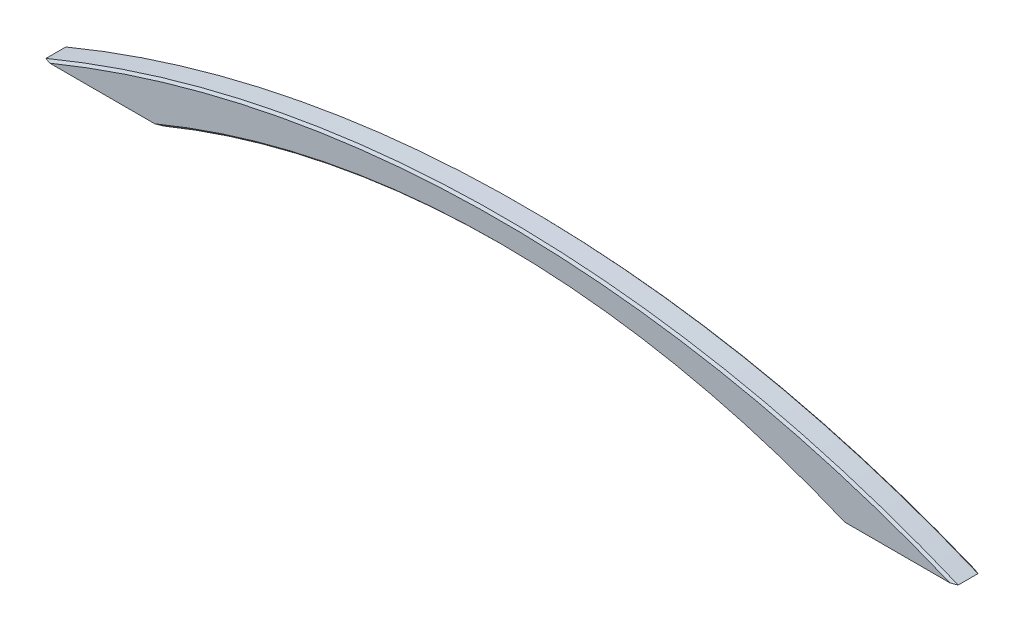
ISO-10303-21;
HEADER;
FILE_DESCRIPTION(('STEP AP214'),'2;1');
FILE_NAME('part.step','',(''),(''),'','','');
FILE_SCHEMA(('AUTOMOTIVE_DESIGN { 1 0 10303 214 1 1 1 1 }'));
ENDSEC;
DATA;
#1=APPLICATION_CONTEXT('core data for automotive mechanical design processes');
#2=APPLICATION_PROTOCOL_DEFINITION('international standard','automotive_design',2000,#1);
#3=PRODUCT_CONTEXT('',#1,'mechanical');
#4=PRODUCT('Part','Part','',(#3));
#5=PRODUCT_RELATED_PRODUCT_CATEGORY('part','',(#4));
#6=PRODUCT_DEFINITION_FORMATION('','',#4);
#7=PRODUCT_DEFINITION_CONTEXT('part definition',#1,'design');
#8=PRODUCT_DEFINITION('design','',#6,#7);
#9=PRODUCT_DEFINITION_SHAPE('','',#8);
#10=(LENGTH_UNIT() NAMED_UNIT(*) SI_UNIT(.MILLI.,.METRE.));
#11=(NAMED_UNIT(*) PLANE_ANGLE_UNIT() SI_UNIT($,.RADIAN.));
#12=(NAMED_UNIT(*) SI_UNIT($,.STERADIAN.) SOLID_ANGLE_UNIT());
#13=UNCERTAINTY_MEASURE_WITH_UNIT(LENGTH_MEASURE(1.E-05),#10,'distance_accuracy_value','');
#14=(GEOMETRIC_REPRESENTATION_CONTEXT(3) GLOBAL_UNCERTAINTY_ASSIGNED_CONTEXT((#13)) GLOBAL_UNIT_ASSIGNED_CONTEXT((#10,
#11,#12)) REPRESENTATION_CONTEXT('',''));
#15=CARTESIAN_POINT('',(0.,0.,0.));
#16=DIRECTION('',(0.,0.,1.));
#17=DIRECTION('',(1.,0.,0.));
#18=AXIS2_PLACEMENT_3D('',#15,#16,#17);
#19=CARTESIAN_POINT('',(0.,-271.551136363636,4.));
#20=DIRECTION('',(0.,0.,-1.));
#21=DIRECTION('',(-1.,0.,0.));
#22=AXIS2_PLACEMENT_3D('',#19,#20,#21);
#23=CYLINDRICAL_SURFACE('',#22,293.551136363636);
#24=DIRECTION('',(0.,0.,-1.));
#25=VECTOR('',#24,1.);
#26=CARTESIAN_POINT('',(-111.5,0.,4.));
#27=LINE('',#26,#25);
#28=CARTESIAN_POINT('',(-111.5,0.,3.24999999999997));
#29=VERTEX_POINT('',#28);
#30=CARTESIAN_POINT('',(-111.5,0.,-3.24999999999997));
#31=VERTEX_POINT('',#30);
#32=EDGE_CURVE('E167',#29,#31,#27,.T.);
#33=ORIENTED_EDGE('',*,*,#32,.T.);
#34=CARTESIAN_POINT('',(0.,-271.551136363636,-3.24999999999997));
#35=DIRECTION('',(0.,0.,-1.));
#36=DIRECTION('',(-1.,0.,0.));
#37=AXIS2_PLACEMENT_3D('',#34,#35,#36);
#38=CIRCLE('',#37,293.551136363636);
#39=CARTESIAN_POINT('',(111.5,0.,-3.24999999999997));
#40=VERTEX_POINT('',#39);
#41=EDGE_CURVE('E191',#31,#40,#38,.T.);
#42=ORIENTED_EDGE('',*,*,#41,.T.);
#43=DIRECTION('',(0.,0.,-1.));
#44=VECTOR('',#43,1.);
#45=CARTESIAN_POINT('',(111.5,0.,4.));
#46=LINE('',#45,#44);
#47=CARTESIAN_POINT('',(111.5,0.,3.24999999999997));
#48=VERTEX_POINT('',#47);
#49=EDGE_CURVE('E184',#48,#40,#46,.T.);
#50=ORIENTED_EDGE('',*,*,#49,.F.);
#51=CARTESIAN_POINT('',(0.,-271.551136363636,3.24999999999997));
#52=DIRECTION('',(0.,0.,-1.));
#53=DIRECTION('',(-1.,0.,0.));
#54=AXIS2_PLACEMENT_3D('',#51,#52,#53);
#55=CIRCLE('',#54,293.551136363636);
#56=EDGE_CURVE('E188',#48,#29,#55,.F.);
#57=ORIENTED_EDGE('',*,*,#56,.T.);
#58=EDGE_LOOP('',(#33,#42,#50,#57));
#59=FACE_BOUND('',#58,.T.);
#60=ADVANCED_FACE('F58',(#59),#23,.F.);
#61=CARTESIAN_POINT('',(150.,0.,4.));
#62=DIRECTION('',(0.,1.,0.));
#63=DIRECTION('',(-1.,0.,0.));
#64=AXIS2_PLACEMENT_3D('',#61,#62,#63);
#65=PLANE('',#64);
#66=CARTESIAN_POINT('',(125.,1.84032655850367E-13,0.));
#67=DIRECTION('',(0.,-1.,0.));
#68=DIRECTION('',(0.,0.,-1.));
#69=AXIS2_PLACEMENT_3D('',#66,#67,#68);
#70=CIRCLE('',#69,1.64999999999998);
#71=CARTESIAN_POINT('',(125.,1.84032655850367E-13,-1.64999999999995));
#72=VERTEX_POINT('',#71);
#73=EDGE_CURVE('E142',#72,#72,#70,.T.);
#74=ORIENTED_EDGE('',*,*,#73,.F.);
#75=EDGE_LOOP('',(#74));
#76=FACE_BOUND('',#75,.T.);
#77=ORIENTED_EDGE('',*,*,#49,.T.);
#78=CARTESIAN_POINT('',(111.5,0.,-3.24999999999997));
#79=CARTESIAN_POINT('',(111.826953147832,0.,-3.37418920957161));
#80=CARTESIAN_POINT('',(112.153751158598,0.,-3.49878381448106));
#81=CARTESIAN_POINT('',(112.807036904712,0.,-3.74878381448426));
#82=CARTESIAN_POINT('',(113.133524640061,0.,-3.87418920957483));
#83=CARTESIAN_POINT('',(113.459857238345,0.,-4.00000000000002));
#84=B_SPLINE_CURVE_WITH_KNOTS('',3,(#78,#79,#80,#81,#82,#83),.UNSPECIFIED.,.F.,.F.,(4,2,4),(0.,
1.04923152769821,2.09846305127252),.UNSPECIFIED.);
#85=CARTESIAN_POINT('',(113.459857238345,0.,-4.));
#86=VERTEX_POINT('',#85);
#87=EDGE_CURVE('E229',#40,#86,#84,.T.);
#88=ORIENTED_EDGE('',*,*,#87,.T.);
#89=DIRECTION('',(1.,0.,0.));
#90=VECTOR('',#89,1.);
#91=CARTESIAN_POINT('',(150.,0.,-4.));
#92=LINE('',#91,#90);
#93=CARTESIAN_POINT('',(148.039057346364,0.,-4.));
#94=VERTEX_POINT('',#93);
#95=EDGE_CURVE('E157',#86,#94,#92,.T.);
#96=ORIENTED_EDGE('',*,*,#95,.T.);
#97=CARTESIAN_POINT('',(148.039057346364,0.,-4.));
#98=CARTESIAN_POINT('',(148.366115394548,0.,-3.8756125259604));
#99=CARTESIAN_POINT('',(148.693056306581,0.,-3.75091878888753));
#100=CARTESIAN_POINT('',(149.346703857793,0.,-3.50091878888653));
#101=CARTESIAN_POINT('',(149.673410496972,0.,-3.37561252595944));
#102=CARTESIAN_POINT('',(150.,0.,-3.25000000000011));
#103=B_SPLINE_CURVE_WITH_KNOTS('',3,(#97,#98,#99,#100,#101,#102),.UNSPECIFIED.,.F.,.F.,(4,2,4),
(0.,1.04973805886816,2.09947611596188),.UNSPECIFIED.);
#104=CARTESIAN_POINT('',(150.,0.,-3.25000000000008));
#105=VERTEX_POINT('',#104);
#106=EDGE_CURVE('E203',#94,#105,#103,.T.);
#107=ORIENTED_EDGE('',*,*,#106,.T.);
#108=DIRECTION('',(0.,0.,-1.));
#109=VECTOR('',#108,1.);
#110=CARTESIAN_POINT('',(150.,0.,4.));
#111=LINE('',#110,#109);
#112=CARTESIAN_POINT('',(150.,0.,3.24999999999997));
#113=VERTEX_POINT('',#112);
#114=EDGE_CURVE('E180',#113,#105,#111,.T.);
#115=ORIENTED_EDGE('',*,*,#114,.F.);
#116=CARTESIAN_POINT('',(150.,0.,3.24999999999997));
#117=CARTESIAN_POINT('',(149.673410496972,0.,3.37561252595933));
#118=CARTESIAN_POINT('',(149.346703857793,0.,3.50091878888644));
#119=CARTESIAN_POINT('',(148.693056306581,0.,3.75091878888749));
#120=CARTESIAN_POINT('',(148.366115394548,0.,3.87561252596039));
#121=CARTESIAN_POINT('',(148.039057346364,0.,4.00000000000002));
#122=B_SPLINE_CURVE_WITH_KNOTS('',3,(#116,#117,#118,#119,#120,#121),.UNSPECIFIED.,.F.,.F.,(4,2,
4),(0.,1.04973805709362,2.09947611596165),.UNSPECIFIED.);
#123=CARTESIAN_POINT('',(148.039057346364,0.,4.));
#124=VERTEX_POINT('',#123);
#125=EDGE_CURVE('E195',#113,#124,#122,.T.);
#126=ORIENTED_EDGE('',*,*,#125,.T.);
#127=DIRECTION('',(1.,0.,0.));
#128=VECTOR('',#127,1.);
#129=CARTESIAN_POINT('',(150.,0.,4.));
#130=LINE('',#129,#128);
#131=CARTESIAN_POINT('',(113.459857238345,0.,4.));
#132=VERTEX_POINT('',#131);
#133=EDGE_CURVE('E158',#132,#124,#130,.T.);
#134=ORIENTED_EDGE('',*,*,#133,.F.);
#135=CARTESIAN_POINT('',(113.459857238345,0.,4.));
#136=CARTESIAN_POINT('',(113.133524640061,0.,3.87418920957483));
#137=CARTESIAN_POINT('',(112.807036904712,0.,3.74878381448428));
#138=CARTESIAN_POINT('',(112.153751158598,0.,3.49878381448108));
#139=CARTESIAN_POINT('',(111.826953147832,0.,3.37418920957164));
#140=CARTESIAN_POINT('',(111.5,0.,3.24999999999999));
#141=B_SPLINE_CURVE_WITH_KNOTS('',3,(#135,#136,#137,#138,#139,#140),.UNSPECIFIED.,.F.,.F.,(4,2,
4),(0.,1.04923152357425,2.09846305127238),.UNSPECIFIED.);
#142=EDGE_CURVE('E222',#132,#48,#141,.T.);
#143=ORIENTED_EDGE('',*,*,#142,.T.);
#144=EDGE_LOOP('',(#77,#88,#96,#107,#115,#126,#134,#143));
#145=FACE_BOUND('',#144,.T.);
#146=ADVANCED_FACE('F209',(#76,#145),#65,.F.);
#147=CARTESIAN_POINT('',(0.,-360.,4.));
#148=DIRECTION('',(0.,0.,-1.));
#149=DIRECTION('',(-1.,0.,0.));
#150=AXIS2_PLACEMENT_3D('',#147,#148,#149);
#151=CYLINDRICAL_SURFACE('',#150,390.);
#152=ORIENTED_EDGE('',*,*,#114,.T.);
#153=CARTESIAN_POINT('',(0.,-360.,-3.25000000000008));
#154=DIRECTION('',(0.,0.,-1.));
#155=DIRECTION('',(-1.,0.,0.));
#156=AXIS2_PLACEMENT_3D('',#153,#154,#155);
#157=CIRCLE('',#156,390.);
#158=CARTESIAN_POINT('',(-150.,0.,-3.25000000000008));
#159=VERTEX_POINT('',#158);
#160=EDGE_CURVE('E13',#105,#159,#157,.F.);
#161=ORIENTED_EDGE('',*,*,#160,.T.);
#162=DIRECTION('',(0.,0.,-1.));
#163=VECTOR('',#162,1.);
#164=CARTESIAN_POINT('',(-150.,0.,4.));
#165=LINE('',#164,#163);
#166=CARTESIAN_POINT('',(-150.,0.,3.24999999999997));
#167=VERTEX_POINT('',#166);
#168=EDGE_CURVE('E177',#167,#159,#165,.T.);
#169=ORIENTED_EDGE('',*,*,#168,.F.);
#170=CARTESIAN_POINT('',(0.,-360.,3.24999999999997));
#171=DIRECTION('',(0.,0.,-1.));
#172=DIRECTION('',(-1.,0.,0.));
#173=AXIS2_PLACEMENT_3D('',#170,#171,#172);
#174=CIRCLE('',#173,390.);
#175=EDGE_CURVE('E69',#167,#113,#174,.T.);
#176=ORIENTED_EDGE('',*,*,#175,.T.);
#177=EDGE_LOOP('',(#152,#161,#169,#176));
#178=FACE_BOUND('',#177,.T.);
#179=ADVANCED_FACE('F214',(#178),#151,.T.);
#180=CARTESIAN_POINT('',(-111.5,0.,4.));
#181=DIRECTION('',(0.,1.,0.));
#182=DIRECTION('',(-1.,0.,0.));
#183=AXIS2_PLACEMENT_3D('',#180,#181,#182);
#184=PLANE('',#183);
#185=CARTESIAN_POINT('',(-125.,-1.86739125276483E-13,0.));
#186=DIRECTION('',(0.,-1.,0.));
#187=DIRECTION('',(0.,0.,-1.));
#188=AXIS2_PLACEMENT_3D('',#185,#186,#187);
#189=CIRCLE('',#188,1.64999999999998);
#190=CARTESIAN_POINT('',(-125.,-1.86739125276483E-13,-1.65000000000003));
#191=VERTEX_POINT('',#190);
#192=EDGE_CURVE('E143',#191,#191,#189,.T.);
#193=ORIENTED_EDGE('',*,*,#192,.F.);
#194=EDGE_LOOP('',(#193));
#195=FACE_BOUND('',#194,.T.);
#196=DIRECTION('',(1.,0.,0.));
#197=VECTOR('',#196,1.);
#198=CARTESIAN_POINT('',(-111.5,0.,-4.));
#199=LINE('',#198,#197);
#200=CARTESIAN_POINT('',(-148.039057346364,0.,-4.));
#201=VERTEX_POINT('',#200);
#202=CARTESIAN_POINT('',(-113.459857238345,0.,-4.));
#203=VERTEX_POINT('',#202);
#204=EDGE_CURVE('E163',#201,#203,#199,.T.);
#205=ORIENTED_EDGE('',*,*,#204,.T.);
#206=CARTESIAN_POINT('',(-113.459857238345,0.,-4.));
#207=CARTESIAN_POINT('',(-113.133524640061,0.,-3.87418920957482));
#208=CARTESIAN_POINT('',(-112.807036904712,0.,-3.74878381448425));
#209=CARTESIAN_POINT('',(-112.153751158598,0.,-3.49878381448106));
#210=CARTESIAN_POINT('',(-111.826953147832,0.,-3.37418920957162));
#211=CARTESIAN_POINT('',(-111.5,0.,-3.24999999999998));
#212=B_SPLINE_CURVE_WITH_KNOTS('',3,(#206,#207,#208,#209,#210,#211),.UNSPECIFIED.,.F.,.F.,(4,2,
4),(0.,1.04923152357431,2.09846305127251),.UNSPECIFIED.);
#213=EDGE_CURVE('E258',#203,#31,#212,.T.);
#214=ORIENTED_EDGE('',*,*,#213,.T.);
#215=ORIENTED_EDGE('',*,*,#32,.F.);
#216=CARTESIAN_POINT('',(-111.5,0.,3.24999999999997));
#217=CARTESIAN_POINT('',(-111.826953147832,0.,3.37418920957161));
#218=CARTESIAN_POINT('',(-112.153751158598,0.,3.49878381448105));
#219=CARTESIAN_POINT('',(-112.807036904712,0.,3.74878381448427));
#220=CARTESIAN_POINT('',(-113.133524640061,0.,3.87418920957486));
#221=CARTESIAN_POINT('',(-113.459857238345,0.,4.00000000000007));
#222=B_SPLINE_CURVE_WITH_KNOTS('',3,(#216,#217,#218,#219,#220,#221),.UNSPECIFIED.,.F.,.F.,(4,2,
4),(0.,1.04923152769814,2.0984630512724),.UNSPECIFIED.);
#223=CARTESIAN_POINT('',(-113.459857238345,0.,4.));
#224=VERTEX_POINT('',#223);
#225=EDGE_CURVE('E250',#29,#224,#222,.T.);
#226=ORIENTED_EDGE('',*,*,#225,.T.);
#227=DIRECTION('',(1.,0.,0.));
#228=VECTOR('',#227,1.);
#229=CARTESIAN_POINT('',(-111.5,0.,4.));
#230=LINE('',#229,#228);
#231=CARTESIAN_POINT('',(-148.039057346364,0.,4.));
#232=VERTEX_POINT('',#231);
#233=EDGE_CURVE('E162',#232,#224,#230,.T.);
#234=ORIENTED_EDGE('',*,*,#233,.F.);
#235=CARTESIAN_POINT('',(-148.039057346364,0.,4.));
#236=CARTESIAN_POINT('',(-148.366115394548,0.,3.87561252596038));
#237=CARTESIAN_POINT('',(-148.693056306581,0.,3.75091878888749));
#238=CARTESIAN_POINT('',(-149.346703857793,0.,3.50091878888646));
#239=CARTESIAN_POINT('',(-149.673410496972,0.,3.37561252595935));
#240=CARTESIAN_POINT('',(-150.,0.,3.25));
#241=B_SPLINE_CURVE_WITH_KNOTS('',3,(#235,#236,#237,#238,#239,#240),.UNSPECIFIED.,.F.,.F.,(4,2,
4),(0.,1.04973805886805,2.09947611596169),.UNSPECIFIED.);
#242=EDGE_CURVE('E83',#232,#167,#241,.T.);
#243=ORIENTED_EDGE('',*,*,#242,.T.);
#244=ORIENTED_EDGE('',*,*,#168,.T.);
#245=CARTESIAN_POINT('',(-150.,0.,-3.25000000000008));
#246=CARTESIAN_POINT('',(-149.673410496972,0.,-3.37561252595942));
#247=CARTESIAN_POINT('',(-149.346703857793,0.,-3.50091878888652));
#248=CARTESIAN_POINT('',(-148.693056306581,0.,-3.75091878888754));
#249=CARTESIAN_POINT('',(-148.366115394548,0.,-3.87561252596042));
#250=CARTESIAN_POINT('',(-148.039057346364,0.,-4.00000000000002));
#251=B_SPLINE_CURVE_WITH_KNOTS('',3,(#245,#246,#247,#248,#249,#250),.UNSPECIFIED.,.F.,.F.,(4,2,
4),(0.,1.04973805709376,2.09947611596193),.UNSPECIFIED.);
#252=EDGE_CURVE('E76',#159,#201,#251,.T.);
#253=ORIENTED_EDGE('',*,*,#252,.T.);
#254=EDGE_LOOP('',(#205,#214,#215,#226,#234,#243,#244,#253));
#255=FACE_BOUND('',#254,.T.);
#256=ADVANCED_FACE('F269',(#195,#255),#184,.F.);
#257=CARTESIAN_POINT('',(0.,-271.551136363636,4.));
#258=DIRECTION('',(0.,0.,-1.));
#259=DIRECTION('',(-1.,0.,0.));
#260=AXIS2_PLACEMENT_3D('',#257,#258,#259);
#261=PLANE('',#260);
#262=ORIENTED_EDGE('',*,*,#233,.T.);
#263=CARTESIAN_POINT('',(0.,-271.551136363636,4.));
#264=DIRECTION('',(0.,0.,-1.));
#265=DIRECTION('',(-1.,0.,0.));
#266=AXIS2_PLACEMENT_3D('',#263,#264,#265);
#267=CIRCLE('',#266,294.301136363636);
#268=EDGE_CURVE('E306',#224,#132,#267,.T.);
#269=ORIENTED_EDGE('',*,*,#268,.T.);
#270=ORIENTED_EDGE('',*,*,#133,.T.);
#271=CARTESIAN_POINT('',(0.,-360.,4.));
#272=DIRECTION('',(0.,0.,-1.));
#273=DIRECTION('',(-1.,0.,0.));
#274=AXIS2_PLACEMENT_3D('',#271,#272,#273);
#275=CIRCLE('',#274,389.25);
#276=EDGE_CURVE('E303',#124,#232,#275,.F.);
#277=ORIENTED_EDGE('',*,*,#276,.T.);
#278=EDGE_LOOP('',(#262,#269,#270,#277));
#279=FACE_BOUND('',#278,.T.);
#280=ADVANCED_FACE('F273',(#279),#261,.F.);
#281=CARTESIAN_POINT('',(0.,-271.551136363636,-4.));
#282=DIRECTION('',(0.,0.,-1.));
#283=DIRECTION('',(-1.,0.,0.));
#284=AXIS2_PLACEMENT_3D('',#281,#282,#283);
#285=PLANE('',#284);
#286=ORIENTED_EDGE('',*,*,#95,.F.);
#287=CARTESIAN_POINT('',(0.,-271.551136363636,-4.));
#288=DIRECTION('',(0.,0.,-1.));
#289=DIRECTION('',(-1.,0.,0.));
#290=AXIS2_PLACEMENT_3D('',#287,#288,#289);
#291=CIRCLE('',#290,294.301136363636);
#292=EDGE_CURVE('E286',#86,#203,#291,.F.);
#293=ORIENTED_EDGE('',*,*,#292,.T.);
#294=ORIENTED_EDGE('',*,*,#204,.F.);
#295=CARTESIAN_POINT('',(0.,-360.,-4.));
#296=DIRECTION('',(0.,0.,-1.));
#297=DIRECTION('',(-1.,0.,0.));
#298=AXIS2_PLACEMENT_3D('',#295,#296,#297);
#299=CIRCLE('',#298,389.25);
#300=EDGE_CURVE('E288',#201,#94,#299,.T.);
#301=ORIENTED_EDGE('',*,*,#300,.T.);
#302=EDGE_LOOP('',(#286,#293,#294,#301));
#303=FACE_BOUND('',#302,.T.);
#304=ADVANCED_FACE('F275',(#303),#285,.T.);
#305=CARTESIAN_POINT('',(125.,6.00000000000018,0.));
#306=DIRECTION('',(0.,-1.,0.));
#307=DIRECTION('',(0.,0.,-1.));
#308=AXIS2_PLACEMENT_3D('',#305,#306,#307);
#309=CONICAL_SURFACE('',#308,1.64999999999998,1.02974425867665);
#310=CARTESIAN_POINT('',(125.,6.99142002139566,0.));
#311=VERTEX_POINT('',#310);
#312=VERTEX_LOOP('',#311);
#313=FACE_BOUND('',#312,.T.);
#314=CARTESIAN_POINT('',(125.,6.00000000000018,0.));
#315=DIRECTION('',(0.,-1.,0.));
#316=DIRECTION('',(0.,0.,-1.));
#317=AXIS2_PLACEMENT_3D('',#314,#315,#316);
#318=CIRCLE('',#317,1.64999999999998);
#319=CARTESIAN_POINT('',(125.,6.00000000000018,-1.64999999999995));
#320=VERTEX_POINT('',#319);
#321=EDGE_CURVE('E149',#320,#320,#318,.T.);
#322=ORIENTED_EDGE('',*,*,#321,.T.);
#323=EDGE_LOOP('',(#322));
#324=FACE_BOUND('',#323,.T.);
#325=ADVANCED_FACE('F335',(#313,#324),#309,.F.);
#326=CARTESIAN_POINT('',(125.,1.85385890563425E-13,0.));
#327=DIRECTION('',(0.,-1.,0.));
#328=DIRECTION('',(0.,0.,-1.));
#329=AXIS2_PLACEMENT_3D('',#326,#327,#328);
#330=CYLINDRICAL_SURFACE('',#329,1.64999999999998);
#331=ORIENTED_EDGE('',*,*,#321,.F.);
#332=EDGE_LOOP('',(#331));
#333=FACE_BOUND('',#332,.T.);
#334=ORIENTED_EDGE('',*,*,#73,.T.);
#335=EDGE_LOOP('',(#334));
#336=FACE_BOUND('',#335,.T.);
#337=ADVANCED_FACE('F135',(#333,#336),#330,.F.);
#338=CARTESIAN_POINT('',(-125.,5.99999999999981,0.));
#339=DIRECTION('',(0.,-1.,0.));
#340=DIRECTION('',(0.,0.,-1.));
#341=AXIS2_PLACEMENT_3D('',#338,#339,#340);
#342=CONICAL_SURFACE('',#341,1.65,1.02974425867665);
#343=CARTESIAN_POINT('',(-125.,6.99142002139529,0.));
#344=VERTEX_POINT('',#343);
#345=VERTEX_LOOP('',#344);
#346=FACE_BOUND('',#345,.T.);
#347=CARTESIAN_POINT('',(-125.,5.99999999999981,0.));
#348=DIRECTION('',(0.,-1.,0.));
#349=DIRECTION('',(0.,0.,-1.));
#350=AXIS2_PLACEMENT_3D('',#347,#348,#349);
#351=CIRCLE('',#350,1.65);
#352=CARTESIAN_POINT('',(-125.,5.99999999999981,-1.65000000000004));
#353=VERTEX_POINT('',#352);
#354=EDGE_CURVE('E139',#353,#353,#351,.T.);
#355=ORIENTED_EDGE('',*,*,#354,.T.);
#356=EDGE_LOOP('',(#355));
#357=FACE_BOUND('',#356,.T.);
#358=ADVANCED_FACE('F131',(#346,#357),#342,.F.);
#359=CARTESIAN_POINT('',(-125.,-1.85385890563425E-13,0.));
#360=DIRECTION('',(0.,-1.,0.));
#361=DIRECTION('',(0.,0.,-1.));
#362=AXIS2_PLACEMENT_3D('',#359,#360,#361);
#363=CYLINDRICAL_SURFACE('',#362,1.64999999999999);
#364=ORIENTED_EDGE('',*,*,#354,.F.);
#365=EDGE_LOOP('',(#364));
#366=FACE_BOUND('',#365,.T.);
#367=ORIENTED_EDGE('',*,*,#192,.T.);
#368=EDGE_LOOP('',(#367));
#369=FACE_BOUND('',#368,.T.);
#370=ADVANCED_FACE('F134',(#366,#369),#363,.F.);
#371=CARTESIAN_POINT('',(0.,-271.551136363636,-3.24999999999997));
#372=DIRECTION('',(0.,0.,-1.));
#373=DIRECTION('',(-1.,0.,0.));
#374=AXIS2_PLACEMENT_3D('',#371,#372,#373);
#375=CONICAL_SURFACE('',#374,293.551136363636,0.785398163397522);
#376=ORIENTED_EDGE('',*,*,#213,.F.);
#377=ORIENTED_EDGE('',*,*,#292,.F.);
#378=ORIENTED_EDGE('',*,*,#87,.F.);
#379=ORIENTED_EDGE('',*,*,#41,.F.);
#380=EDGE_LOOP('',(#376,#377,#378,#379));
#381=FACE_BOUND('',#380,.T.);
#382=ADVANCED_FACE('F244',(#381),#375,.F.);
#383=CARTESIAN_POINT('',(0.,-271.551136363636,4.));
#384=DIRECTION('',(0.,0.,1.));
#385=DIRECTION('',(1.,0.,0.));
#386=AXIS2_PLACEMENT_3D('',#383,#384,#385);
#387=CONICAL_SURFACE('',#386,294.301136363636,0.785398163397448);
#388=ORIENTED_EDGE('',*,*,#225,.F.);
#389=ORIENTED_EDGE('',*,*,#56,.F.);
#390=ORIENTED_EDGE('',*,*,#142,.F.);
#391=ORIENTED_EDGE('',*,*,#268,.F.);
#392=EDGE_LOOP('',(#388,#389,#390,#391));
#393=FACE_BOUND('',#392,.T.);
#394=ADVANCED_FACE('F236',(#393),#387,.F.);
#395=CARTESIAN_POINT('',(0.,-360.,-3.25000000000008));
#396=DIRECTION('',(0.,0.,1.));
#397=DIRECTION('',(1.,0.,0.));
#398=AXIS2_PLACEMENT_3D('',#395,#396,#397);
#399=CONICAL_SURFACE('',#398,390.,0.785398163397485);
#400=ORIENTED_EDGE('',*,*,#106,.F.);
#401=ORIENTED_EDGE('',*,*,#300,.F.);
#402=ORIENTED_EDGE('',*,*,#252,.F.);
#403=ORIENTED_EDGE('',*,*,#160,.F.);
#404=EDGE_LOOP('',(#400,#401,#402,#403));
#405=FACE_BOUND('',#404,.T.);
#406=ADVANCED_FACE('F243',(#405),#399,.T.);
#407=CARTESIAN_POINT('',(0.,-360.,4.));
#408=DIRECTION('',(0.,0.,-1.));
#409=DIRECTION('',(-1.,0.,0.));
#410=AXIS2_PLACEMENT_3D('',#407,#408,#409);
#411=CONICAL_SURFACE('',#410,389.25,0.785398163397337);
#412=ORIENTED_EDGE('',*,*,#125,.F.);
#413=ORIENTED_EDGE('',*,*,#175,.F.);
#414=ORIENTED_EDGE('',*,*,#242,.F.);
#415=ORIENTED_EDGE('',*,*,#276,.F.);
#416=EDGE_LOOP('',(#412,#413,#414,#415));
#417=FACE_BOUND('',#416,.T.);
#418=ADVANCED_FACE('F61',(#417),#411,.T.);
#419=CLOSED_SHELL('',(#60,#146,#179,#256,#280,#304,#325,#337,#358,#370,#382,#394,#406,#418));
#420=MANIFOLD_SOLID_BREP('B2',#419);
#421=ADVANCED_BREP_SHAPE_REPRESENTATION('',(#18,#420),#14);
#422=SHAPE_DEFINITION_REPRESENTATION(#9,#421);
ENDSEC;
END-ISO-10303-21;
